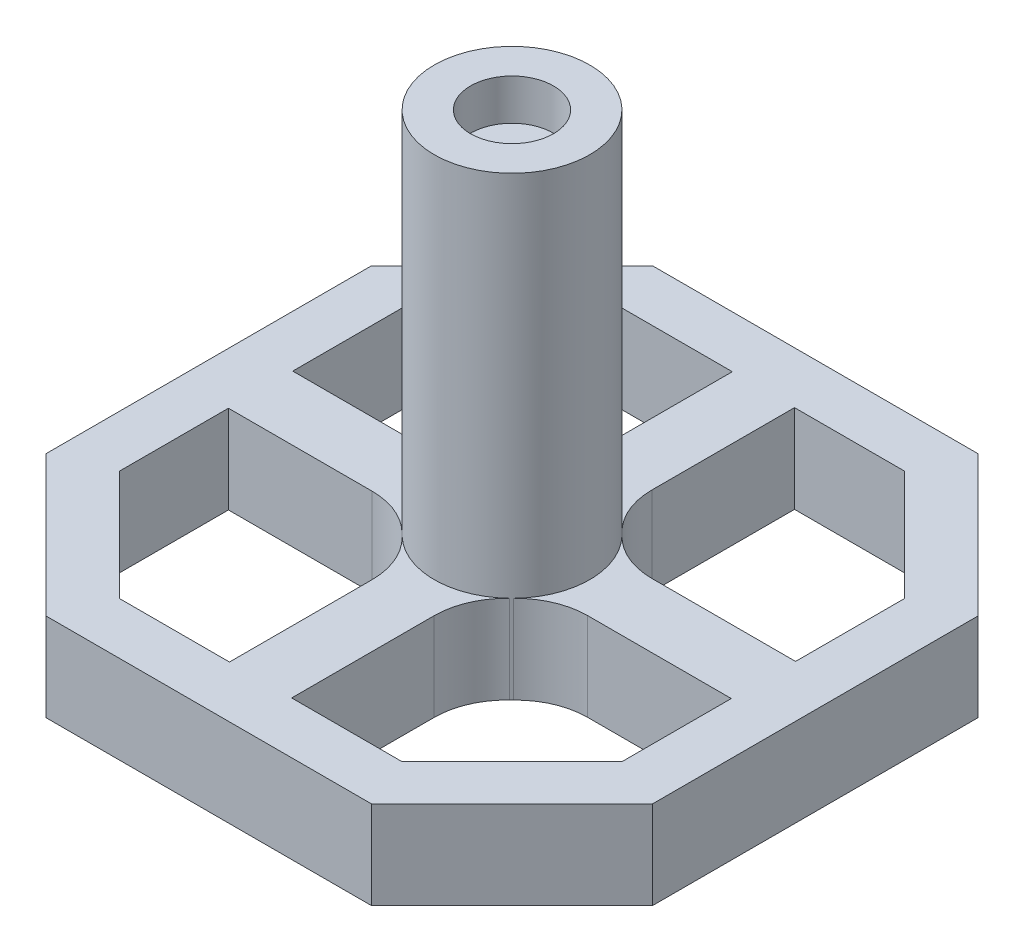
ISO-10303-21;
HEADER;
FILE_DESCRIPTION(('STEP AP214'),'2;1');
FILE_NAME('part.step','',(''),(''),'','','');
FILE_SCHEMA(('AUTOMOTIVE_DESIGN { 1 0 10303 214 1 1 1 1 }'));
ENDSEC;
DATA;
#1=APPLICATION_CONTEXT('core data for automotive mechanical design processes');
#2=APPLICATION_PROTOCOL_DEFINITION('international standard','automotive_design',2000,#1);
#3=PRODUCT_CONTEXT('',#1,'mechanical');
#4=PRODUCT('Part','Part','',(#3));
#5=PRODUCT_RELATED_PRODUCT_CATEGORY('part','',(#4));
#6=PRODUCT_DEFINITION_FORMATION('','',#4);
#7=PRODUCT_DEFINITION_CONTEXT('part definition',#1,'design');
#8=PRODUCT_DEFINITION('design','',#6,#7);
#9=PRODUCT_DEFINITION_SHAPE('','',#8);
#10=(LENGTH_UNIT() NAMED_UNIT(*) SI_UNIT(.MILLI.,.METRE.));
#11=(NAMED_UNIT(*) PLANE_ANGLE_UNIT() SI_UNIT($,.RADIAN.));
#12=(NAMED_UNIT(*) SI_UNIT($,.STERADIAN.) SOLID_ANGLE_UNIT());
#13=UNCERTAINTY_MEASURE_WITH_UNIT(LENGTH_MEASURE(1.E-05),#10,'distance_accuracy_value','');
#14=(GEOMETRIC_REPRESENTATION_CONTEXT(3) GLOBAL_UNCERTAINTY_ASSIGNED_CONTEXT((#13)) GLOBAL_UNIT_ASSIGNED_CONTEXT((#10,
#11,#12)) REPRESENTATION_CONTEXT('',''));
#15=CARTESIAN_POINT('',(0.,0.,0.));
#16=DIRECTION('',(0.,0.,1.));
#17=DIRECTION('',(1.,0.,0.));
#18=AXIS2_PLACEMENT_3D('',#15,#16,#17);
#19=CARTESIAN_POINT('',(0.,22.352,0.));
#20=DIRECTION('',(0.,-1.,0.));
#21=DIRECTION('',(0.,0.,-1.));
#22=AXIS2_PLACEMENT_3D('',#19,#20,#21);
#23=CYLINDRICAL_SURFACE('',#22,3.81);
#24=CARTESIAN_POINT('',(0.,0.,0.));
#25=DIRECTION('',(0.,1.,0.));
#26=DIRECTION('',(0.,0.,1.));
#27=AXIS2_PLACEMENT_3D('',#24,#25,#26);
#28=CIRCLE('',#27,3.81);
#29=CARTESIAN_POINT('',(2.7337000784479,0.,-2.65386206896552));
#30=VERTEX_POINT('',#29);
#31=CARTESIAN_POINT('',(2.62758620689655,0.,-2.75896551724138));
#32=VERTEX_POINT('',#31);
#33=EDGE_CURVE('E585',#30,#32,#28,.T.);
#34=ORIENTED_EDGE('',*,*,#33,.T.);
#35=DIRECTION('',(0.,-1.,0.));
#36=VECTOR('',#35,1.);
#37=CARTESIAN_POINT('',(2.62758620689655,22.352,-2.75896551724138));
#38=LINE('',#37,#36);
#39=CARTESIAN_POINT('',(2.62758620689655,4.318,-2.75896551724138));
#40=VERTEX_POINT('',#39);
#41=EDGE_CURVE('E617',#32,#40,#38,.F.);
#42=ORIENTED_EDGE('',*,*,#41,.T.);
#43=CARTESIAN_POINT('',(0.,4.318,0.));
#44=DIRECTION('',(0.,-1.,0.));
#45=DIRECTION('',(0.,0.,-1.));
#46=AXIS2_PLACEMENT_3D('',#43,#44,#45);
#47=CIRCLE('',#46,3.81);
#48=CARTESIAN_POINT('',(-2.62758620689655,4.318,-2.75896551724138));
#49=VERTEX_POINT('',#48);
#50=EDGE_CURVE('E369',#49,#40,#47,.T.);
#51=ORIENTED_EDGE('',*,*,#50,.F.);
#52=DIRECTION('',(0.,-1.,0.));
#53=VECTOR('',#52,1.);
#54=CARTESIAN_POINT('',(-2.62758620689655,22.352,-2.75896551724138));
#55=LINE('',#54,#53);
#56=CARTESIAN_POINT('',(-2.62758620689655,0.,-2.75896551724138));
#57=VERTEX_POINT('',#56);
#58=EDGE_CURVE('E609',#49,#57,#55,.T.);
#59=ORIENTED_EDGE('',*,*,#58,.T.);
#60=CARTESIAN_POINT('',(-2.7337000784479,0.,-2.65386206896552));
#61=VERTEX_POINT('',#60);
#62=EDGE_CURVE('E846',#57,#61,#28,.T.);
#63=ORIENTED_EDGE('',*,*,#62,.T.);
#64=DIRECTION('',(0.,-1.,0.));
#65=VECTOR('',#64,1.);
#66=CARTESIAN_POINT('',(-2.7337000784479,22.352,-2.65386206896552));
#67=LINE('',#66,#65);
#68=CARTESIAN_POINT('',(-2.7337000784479,4.318,-2.65386206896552));
#69=VERTEX_POINT('',#68);
#70=EDGE_CURVE('E605',#61,#69,#67,.F.);
#71=ORIENTED_EDGE('',*,*,#70,.T.);
#72=CARTESIAN_POINT('',(-2.7337000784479,4.318,2.65386206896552));
#73=VERTEX_POINT('',#72);
#74=EDGE_CURVE('E864',#73,#69,#47,.T.);
#75=ORIENTED_EDGE('',*,*,#74,.F.);
#76=DIRECTION('',(0.,-1.,0.));
#77=VECTOR('',#76,1.);
#78=CARTESIAN_POINT('',(-2.7337000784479,22.352,2.65386206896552));
#79=LINE('',#78,#77);
#80=CARTESIAN_POINT('',(-2.7337000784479,0.,2.65386206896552));
#81=VERTEX_POINT('',#80);
#82=EDGE_CURVE('E601',#73,#81,#79,.T.);
#83=ORIENTED_EDGE('',*,*,#82,.T.);
#84=CARTESIAN_POINT('',(-2.62758620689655,0.,2.75896551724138));
#85=VERTEX_POINT('',#84);
#86=EDGE_CURVE('E500',#81,#85,#28,.T.);
#87=ORIENTED_EDGE('',*,*,#86,.T.);
#88=DIRECTION('',(0.,-1.,0.));
#89=VECTOR('',#88,1.);
#90=CARTESIAN_POINT('',(-2.62758620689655,22.352,2.75896551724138));
#91=LINE('',#90,#89);
#92=CARTESIAN_POINT('',(-2.62758620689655,4.318,2.75896551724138));
#93=VERTEX_POINT('',#92);
#94=EDGE_CURVE('E597',#85,#93,#91,.F.);
#95=ORIENTED_EDGE('',*,*,#94,.T.);
#96=CARTESIAN_POINT('',(2.62758620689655,4.318,2.75896551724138));
#97=VERTEX_POINT('',#96);
#98=EDGE_CURVE('E309',#97,#93,#47,.T.);
#99=ORIENTED_EDGE('',*,*,#98,.F.);
#100=DIRECTION('',(0.,-1.,0.));
#101=VECTOR('',#100,1.);
#102=CARTESIAN_POINT('',(2.62758620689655,22.352,2.75896551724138));
#103=LINE('',#102,#101);
#104=CARTESIAN_POINT('',(2.62758620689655,0.,2.75896551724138));
#105=VERTEX_POINT('',#104);
#106=EDGE_CURVE('E593',#97,#105,#103,.T.);
#107=ORIENTED_EDGE('',*,*,#106,.T.);
#108=CARTESIAN_POINT('',(2.7337000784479,0.,2.65386206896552));
#109=VERTEX_POINT('',#108);
#110=EDGE_CURVE('E581',#105,#109,#28,.T.);
#111=ORIENTED_EDGE('',*,*,#110,.T.);
#112=DIRECTION('',(0.,-1.,0.));
#113=VECTOR('',#112,1.);
#114=CARTESIAN_POINT('',(2.7337000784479,22.352,2.65386206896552));
#115=LINE('',#114,#113);
#116=CARTESIAN_POINT('',(2.7337000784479,4.318,2.65386206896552));
#117=VERTEX_POINT('',#116);
#118=EDGE_CURVE('E589',#109,#117,#115,.F.);
#119=ORIENTED_EDGE('',*,*,#118,.T.);
#120=CARTESIAN_POINT('',(2.7337000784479,4.318,-2.65386206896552));
#121=VERTEX_POINT('',#120);
#122=EDGE_CURVE('E364',#121,#117,#47,.T.);
#123=ORIENTED_EDGE('',*,*,#122,.F.);
#124=DIRECTION('',(0.,-1.,0.));
#125=VECTOR('',#124,1.);
#126=CARTESIAN_POINT('',(2.7337000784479,22.352,-2.65386206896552));
#127=LINE('',#126,#125);
#128=EDGE_CURVE('E613',#121,#30,#127,.T.);
#129=ORIENTED_EDGE('',*,*,#128,.T.);
#130=EDGE_LOOP('',(#34,#42,#51,#59,#63,#71,#75,#83,#87,#95,#99,#107,#111,#119,#123,#129));
#131=FACE_BOUND('',#130,.T.);
#132=CARTESIAN_POINT('',(0.,22.352,0.));
#133=DIRECTION('',(0.,1.,0.));
#134=DIRECTION('',(0.,0.,1.));
#135=AXIS2_PLACEMENT_3D('',#132,#133,#134);
#136=CIRCLE('',#135,3.81);
#137=CARTESIAN_POINT('',(0.,22.352,3.81));
#138=VERTEX_POINT('',#137);
#139=EDGE_CURVE('E576',#138,#138,#136,.T.);
#140=ORIENTED_EDGE('',*,*,#139,.F.);
#141=EDGE_LOOP('',(#140));
#142=FACE_BOUND('',#141,.T.);
#143=ADVANCED_FACE('F41',(#131,#142),#23,.T.);
#144=CARTESIAN_POINT('',(0.,22.352,0.));
#145=DIRECTION('',(0.,1.,0.));
#146=DIRECTION('',(0.,0.,1.));
#147=AXIS2_PLACEMENT_3D('',#144,#145,#146);
#148=PLANE('',#147);
#149=CARTESIAN_POINT('',(0.,22.352,0.));
#150=DIRECTION('',(0.,1.,0.));
#151=DIRECTION('',(0.,0.,1.));
#152=AXIS2_PLACEMENT_3D('',#149,#150,#151);
#153=CIRCLE('',#152,2.032);
#154=CARTESIAN_POINT('',(0.,22.352,2.032));
#155=VERTEX_POINT('',#154);
#156=EDGE_CURVE('E902',#155,#155,#153,.T.);
#157=ORIENTED_EDGE('',*,*,#156,.F.);
#158=EDGE_LOOP('',(#157));
#159=FACE_BOUND('',#158,.T.);
#160=ORIENTED_EDGE('',*,*,#139,.T.);
#161=EDGE_LOOP('',(#160));
#162=FACE_BOUND('',#161,.T.);
#163=ADVANCED_FACE('F736',(#159,#162),#148,.T.);
#164=CARTESIAN_POINT('',(0.,0.,0.));
#165=DIRECTION('',(0.,1.,0.));
#166=DIRECTION('',(0.,0.,1.));
#167=AXIS2_PLACEMENT_3D('',#164,#165,#166);
#168=PLANE('',#167);
#169=DIRECTION('',(0.,0.,-1.));
#170=VECTOR('',#169,1.);
#171=CARTESIAN_POINT('',(-1.524,0.,0.));
#172=LINE('',#171,#170);
#173=CARTESIAN_POINT('',(-1.524,0.,12.319));
#174=VERTEX_POINT('',#173);
#175=CARTESIAN_POINT('',(-1.524,0.,5.334));
#176=VERTEX_POINT('',#175);
#177=EDGE_CURVE('E319',#174,#176,#172,.T.);
#178=ORIENTED_EDGE('',*,*,#177,.T.);
#179=CARTESIAN_POINT('',(-5.08,0.,5.334));
#180=DIRECTION('',(0.,1.,0.));
#181=DIRECTION('',(0.,0.,1.));
#182=AXIS2_PLACEMENT_3D('',#179,#180,#181);
#183=CIRCLE('',#182,3.556);
#184=EDGE_CURVE('E677',#176,#85,#183,.T.);
#185=ORIENTED_EDGE('',*,*,#184,.T.);
#186=ORIENTED_EDGE('',*,*,#86,.F.);
#187=CARTESIAN_POINT('',(-5.28515348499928,0.,5.1308));
#188=DIRECTION('',(0.,1.,0.));
#189=DIRECTION('',(0.,0.,1.));
#190=AXIS2_PLACEMENT_3D('',#187,#188,#189);
#191=CIRCLE('',#190,3.556);
#192=CARTESIAN_POINT('',(-5.28515348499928,0.,1.5748));
#193=VERTEX_POINT('',#192);
#194=EDGE_CURVE('E670',#81,#193,#191,.T.);
#195=ORIENTED_EDGE('',*,*,#194,.T.);
#196=DIRECTION('',(1.,0.,0.));
#197=VECTOR('',#196,1.);
#198=CARTESIAN_POINT('',(0.,0.,1.5748));
#199=LINE('',#198,#197);
#200=CARTESIAN_POINT('',(-12.319,0.,1.5748));
#201=VERTEX_POINT('',#200);
#202=EDGE_CURVE('E455',#201,#193,#199,.T.);
#203=ORIENTED_EDGE('',*,*,#202,.F.);
#204=DIRECTION('',(0.,0.,1.));
#205=VECTOR('',#204,1.);
#206=CARTESIAN_POINT('',(-12.319,0.,0.));
#207=LINE('',#206,#205);
#208=CARTESIAN_POINT('',(-12.319,0.,6.92149999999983));
#209=VERTEX_POINT('',#208);
#210=EDGE_CURVE('E485',#201,#209,#207,.T.);
#211=ORIENTED_EDGE('',*,*,#210,.T.);
#212=DIRECTION('',(-0.707106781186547,0.,-0.707106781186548));
#213=VECTOR('',#212,1.);
#214=CARTESIAN_POINT('',(-9.62024999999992,0.,9.62024999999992));
#215=LINE('',#214,#213);
#216=CARTESIAN_POINT('',(-6.92149999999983,0.,12.319));
#217=VERTEX_POINT('',#216);
#218=EDGE_CURVE('E489',#217,#209,#215,.T.);
#219=ORIENTED_EDGE('',*,*,#218,.F.);
#220=DIRECTION('',(1.,0.,0.));
#221=VECTOR('',#220,1.);
#222=CARTESIAN_POINT('',(0.,0.,12.319));
#223=LINE('',#222,#221);
#224=EDGE_CURVE('E493',#217,#174,#223,.T.);
#225=ORIENTED_EDGE('',*,*,#224,.T.);
#226=EDGE_LOOP('',(#178,#185,#186,#195,#203,#211,#219,#225));
#227=FACE_BOUND('',#226,.T.);
#228=DIRECTION('',(1.,0.,0.));
#229=VECTOR('',#228,1.);
#230=CARTESIAN_POINT('',(0.,0.,-1.5748));
#231=LINE('',#230,#229);
#232=CARTESIAN_POINT('',(-12.319,0.,-1.5748));
#233=VERTEX_POINT('',#232);
#234=CARTESIAN_POINT('',(-5.28515348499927,0.,-1.5748));
#235=VERTEX_POINT('',#234);
#236=EDGE_CURVE('E459',#233,#235,#231,.T.);
#237=ORIENTED_EDGE('',*,*,#236,.T.);
#238=CARTESIAN_POINT('',(-5.28515348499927,0.,-5.1308));
#239=DIRECTION('',(0.,1.,0.));
#240=DIRECTION('',(0.,0.,1.));
#241=AXIS2_PLACEMENT_3D('',#238,#239,#240);
#242=CIRCLE('',#241,3.556);
#243=EDGE_CURVE('E664',#235,#61,#242,.T.);
#244=ORIENTED_EDGE('',*,*,#243,.T.);
#245=ORIENTED_EDGE('',*,*,#62,.F.);
#246=CARTESIAN_POINT('',(-5.08,0.,-5.334));
#247=DIRECTION('',(0.,1.,0.));
#248=DIRECTION('',(0.,0.,1.));
#249=AXIS2_PLACEMENT_3D('',#246,#247,#248);
#250=CIRCLE('',#249,3.556);
#251=CARTESIAN_POINT('',(-1.524,0.,-5.334));
#252=VERTEX_POINT('',#251);
#253=EDGE_CURVE('E657',#57,#252,#250,.T.);
#254=ORIENTED_EDGE('',*,*,#253,.T.);
#255=CARTESIAN_POINT('',(-1.524,0.,-12.319));
#256=VERTEX_POINT('',#255);
#257=EDGE_CURVE('E470',#252,#256,#172,.T.);
#258=ORIENTED_EDGE('',*,*,#257,.T.);
#259=DIRECTION('',(-1.,0.,0.));
#260=VECTOR('',#259,1.);
#261=CARTESIAN_POINT('',(0.,0.,-12.319));
#262=LINE('',#261,#260);
#263=CARTESIAN_POINT('',(-6.92149999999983,0.,-12.319));
#264=VERTEX_POINT('',#263);
#265=EDGE_CURVE('E473',#256,#264,#262,.T.);
#266=ORIENTED_EDGE('',*,*,#265,.T.);
#267=DIRECTION('',(0.707106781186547,0.,-0.707106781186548));
#268=VECTOR('',#267,1.);
#269=CARTESIAN_POINT('',(-9.62024999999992,0.,-9.62024999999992));
#270=LINE('',#269,#268);
#271=CARTESIAN_POINT('',(-12.319,0.,-6.92149999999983));
#272=VERTEX_POINT('',#271);
#273=EDGE_CURVE('E477',#272,#264,#270,.T.);
#274=ORIENTED_EDGE('',*,*,#273,.F.);
#275=DIRECTION('',(0.,0.,1.));
#276=VECTOR('',#275,1.);
#277=CARTESIAN_POINT('',(-12.319,0.,0.));
#278=LINE('',#277,#276);
#279=EDGE_CURVE('E481',#272,#233,#278,.T.);
#280=ORIENTED_EDGE('',*,*,#279,.T.);
#281=EDGE_LOOP('',(#237,#244,#245,#254,#258,#266,#274,#280));
#282=FACE_BOUND('',#281,.T.);
#283=DIRECTION('',(0.,0.,-1.));
#284=VECTOR('',#283,1.);
#285=CARTESIAN_POINT('',(1.524,0.,0.));
#286=LINE('',#285,#284);
#287=CARTESIAN_POINT('',(1.524,0.,-5.334));
#288=VERTEX_POINT('',#287);
#289=CARTESIAN_POINT('',(1.524,0.,-12.319));
#290=VERTEX_POINT('',#289);
#291=EDGE_CURVE('E440',#288,#290,#286,.T.);
#292=ORIENTED_EDGE('',*,*,#291,.F.);
#293=CARTESIAN_POINT('',(5.08,0.,-5.334));
#294=DIRECTION('',(0.,1.,0.));
#295=DIRECTION('',(0.,0.,1.));
#296=AXIS2_PLACEMENT_3D('',#293,#294,#295);
#297=CIRCLE('',#296,3.556);
#298=EDGE_CURVE('E644',#288,#32,#297,.T.);
#299=ORIENTED_EDGE('',*,*,#298,.T.);
#300=ORIENTED_EDGE('',*,*,#33,.F.);
#301=CARTESIAN_POINT('',(5.28515348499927,0.,-5.1308));
#302=DIRECTION('',(0.,1.,0.));
#303=DIRECTION('',(0.,0.,1.));
#304=AXIS2_PLACEMENT_3D('',#301,#302,#303);
#305=CIRCLE('',#304,3.556);
#306=CARTESIAN_POINT('',(5.28515348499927,0.,-1.5748));
#307=VERTEX_POINT('',#306);
#308=EDGE_CURVE('E650',#30,#307,#305,.T.);
#309=ORIENTED_EDGE('',*,*,#308,.T.);
#310=CARTESIAN_POINT('',(12.319,0.,-1.5748));
#311=VERTEX_POINT('',#310);
#312=EDGE_CURVE('E454',#307,#311,#231,.T.);
#313=ORIENTED_EDGE('',*,*,#312,.T.);
#314=DIRECTION('',(0.,0.,1.));
#315=VECTOR('',#314,1.);
#316=CARTESIAN_POINT('',(12.319,0.,0.));
#317=LINE('',#316,#315);
#318=CARTESIAN_POINT('',(12.319,0.,-6.92149999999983));
#319=VERTEX_POINT('',#318);
#320=EDGE_CURVE('E458',#319,#311,#317,.T.);
#321=ORIENTED_EDGE('',*,*,#320,.F.);
#322=DIRECTION('',(0.707106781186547,0.,0.707106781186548));
#323=VECTOR('',#322,1.);
#324=CARTESIAN_POINT('',(9.62024999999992,0.,-9.62024999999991));
#325=LINE('',#324,#323);
#326=CARTESIAN_POINT('',(6.92149999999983,0.,-12.319));
#327=VERTEX_POINT('',#326);
#328=EDGE_CURVE('E463',#327,#319,#325,.T.);
#329=ORIENTED_EDGE('',*,*,#328,.F.);
#330=DIRECTION('',(-1.,0.,0.));
#331=VECTOR('',#330,1.);
#332=CARTESIAN_POINT('',(0.,0.,-12.319));
#333=LINE('',#332,#331);
#334=EDGE_CURVE('E466',#327,#290,#333,.T.);
#335=ORIENTED_EDGE('',*,*,#334,.T.);
#336=EDGE_LOOP('',(#292,#299,#300,#309,#313,#321,#329,#335));
#337=FACE_BOUND('',#336,.T.);
#338=ORIENTED_EDGE('',*,*,#110,.F.);
#339=CARTESIAN_POINT('',(5.08,0.,5.334));
#340=DIRECTION('',(0.,1.,0.));
#341=DIRECTION('',(0.,0.,1.));
#342=AXIS2_PLACEMENT_3D('',#339,#340,#341);
#343=CIRCLE('',#342,3.556);
#344=CARTESIAN_POINT('',(1.524,0.,5.334));
#345=VERTEX_POINT('',#344);
#346=EDGE_CURVE('E683',#105,#345,#343,.T.);
#347=ORIENTED_EDGE('',*,*,#346,.T.);
#348=CARTESIAN_POINT('',(1.524,0.,12.319));
#349=VERTEX_POINT('',#348);
#350=EDGE_CURVE('E435',#349,#345,#286,.T.);
#351=ORIENTED_EDGE('',*,*,#350,.F.);
#352=DIRECTION('',(1.,0.,0.));
#353=VECTOR('',#352,1.);
#354=CARTESIAN_POINT('',(0.,0.,12.319));
#355=LINE('',#354,#353);
#356=CARTESIAN_POINT('',(6.92149999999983,0.,12.319));
#357=VERTEX_POINT('',#356);
#358=EDGE_CURVE('E439',#349,#357,#355,.T.);
#359=ORIENTED_EDGE('',*,*,#358,.T.);
#360=DIRECTION('',(-0.707106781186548,0.,0.707106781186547));
#361=VECTOR('',#360,1.);
#362=CARTESIAN_POINT('',(9.62024999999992,0.,9.62024999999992));
#363=LINE('',#362,#361);
#364=CARTESIAN_POINT('',(12.319,0.,6.92149999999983));
#365=VERTEX_POINT('',#364);
#366=EDGE_CURVE('E444',#365,#357,#363,.T.);
#367=ORIENTED_EDGE('',*,*,#366,.F.);
#368=DIRECTION('',(0.,0.,1.));
#369=VECTOR('',#368,1.);
#370=CARTESIAN_POINT('',(12.319,0.,0.));
#371=LINE('',#370,#369);
#372=CARTESIAN_POINT('',(12.319,0.,1.5748));
#373=VERTEX_POINT('',#372);
#374=EDGE_CURVE('E448',#373,#365,#371,.T.);
#375=ORIENTED_EDGE('',*,*,#374,.F.);
#376=CARTESIAN_POINT('',(5.28515348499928,0.,1.5748));
#377=VERTEX_POINT('',#376);
#378=EDGE_CURVE('E451',#377,#373,#199,.T.);
#379=ORIENTED_EDGE('',*,*,#378,.F.);
#380=CARTESIAN_POINT('',(5.28515348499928,0.,5.1308));
#381=DIRECTION('',(0.,1.,0.));
#382=DIRECTION('',(0.,0.,1.));
#383=AXIS2_PLACEMENT_3D('',#380,#381,#382);
#384=CIRCLE('',#383,3.556);
#385=EDGE_CURVE('E50',#377,#109,#384,.T.);
#386=ORIENTED_EDGE('',*,*,#385,.T.);
#387=EDGE_LOOP('',(#338,#347,#351,#359,#367,#375,#379,#386));
#388=FACE_BOUND('',#387,.T.);
#389=DIRECTION('',(-0.707106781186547,0.,-0.707106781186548));
#390=VECTOR('',#389,1.);
#391=CARTESIAN_POINT('',(11.4163012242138,0.,-11.4163012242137));
#392=LINE('',#391,#390);
#393=CARTESIAN_POINT('',(14.859,0.,-7.97360244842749));
#394=VERTEX_POINT('',#393);
#395=CARTESIAN_POINT('',(7.97360244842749,0.,-14.859));
#396=VERTEX_POINT('',#395);
#397=EDGE_CURVE('E410',#394,#396,#392,.T.);
#398=ORIENTED_EDGE('',*,*,#397,.F.);
#399=DIRECTION('',(0.,0.,1.));
#400=VECTOR('',#399,1.);
#401=CARTESIAN_POINT('',(14.859,0.,0.));
#402=LINE('',#401,#400);
#403=CARTESIAN_POINT('',(14.859,0.,7.97360244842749));
#404=VERTEX_POINT('',#403);
#405=EDGE_CURVE('E303',#394,#404,#402,.T.);
#406=ORIENTED_EDGE('',*,*,#405,.T.);
#407=DIRECTION('',(0.707106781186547,0.,-0.707106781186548));
#408=VECTOR('',#407,1.);
#409=CARTESIAN_POINT('',(11.4163012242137,0.,11.4163012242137));
#410=LINE('',#409,#408);
#411=CARTESIAN_POINT('',(7.97360244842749,0.,14.859));
#412=VERTEX_POINT('',#411);
#413=EDGE_CURVE('E416',#412,#404,#410,.T.);
#414=ORIENTED_EDGE('',*,*,#413,.F.);
#415=DIRECTION('',(1.,0.,0.));
#416=VECTOR('',#415,1.);
#417=CARTESIAN_POINT('',(0.,0.,14.859));
#418=LINE('',#417,#416);
#419=CARTESIAN_POINT('',(-7.97360244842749,0.,14.859));
#420=VERTEX_POINT('',#419);
#421=EDGE_CURVE('E420',#420,#412,#418,.T.);
#422=ORIENTED_EDGE('',*,*,#421,.F.);
#423=DIRECTION('',(0.707106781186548,0.,0.707106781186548));
#424=VECTOR('',#423,1.);
#425=CARTESIAN_POINT('',(-11.4163012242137,0.,11.4163012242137));
#426=LINE('',#425,#424);
#427=CARTESIAN_POINT('',(-14.859,0.,7.97360244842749));
#428=VERTEX_POINT('',#427);
#429=EDGE_CURVE('E423',#428,#420,#426,.T.);
#430=ORIENTED_EDGE('',*,*,#429,.F.);
#431=DIRECTION('',(0.,0.,1.));
#432=VECTOR('',#431,1.);
#433=CARTESIAN_POINT('',(-14.859,0.,0.));
#434=LINE('',#433,#432);
#435=CARTESIAN_POINT('',(-14.859,0.,-7.9736024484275));
#436=VERTEX_POINT('',#435);
#437=EDGE_CURVE('E426',#436,#428,#434,.T.);
#438=ORIENTED_EDGE('',*,*,#437,.F.);
#439=DIRECTION('',(-0.707106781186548,0.,0.707106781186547));
#440=VECTOR('',#439,1.);
#441=CARTESIAN_POINT('',(-11.4163012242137,0.,-11.4163012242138));
#442=LINE('',#441,#440);
#443=CARTESIAN_POINT('',(-7.97360244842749,0.,-14.859));
#444=VERTEX_POINT('',#443);
#445=EDGE_CURVE('E429',#444,#436,#442,.T.);
#446=ORIENTED_EDGE('',*,*,#445,.F.);
#447=DIRECTION('',(-1.,0.,0.));
#448=VECTOR('',#447,1.);
#449=CARTESIAN_POINT('',(0.,0.,-14.859));
#450=LINE('',#449,#448);
#451=EDGE_CURVE('E432',#396,#444,#450,.T.);
#452=ORIENTED_EDGE('',*,*,#451,.F.);
#453=EDGE_LOOP('',(#398,#406,#414,#422,#430,#438,#446,#452));
#454=FACE_BOUND('',#453,.T.);
#455=ADVANCED_FACE('F693',(#227,#282,#337,#388,#454),#168,.F.);
#456=CARTESIAN_POINT('',(1.524,4.318,0.));
#457=DIRECTION('',(-1.,0.,0.));
#458=DIRECTION('',(0.,0.,1.));
#459=AXIS2_PLACEMENT_3D('',#456,#457,#458);
#460=PLANE('',#459);
#461=ORIENTED_EDGE('',*,*,#350,.T.);
#462=DIRECTION('',(0.,1.,0.));
#463=VECTOR('',#462,1.);
#464=CARTESIAN_POINT('',(1.524,4.318,5.334));
#465=LINE('',#464,#463);
#466=CARTESIAN_POINT('',(1.524,4.318,5.334));
#467=VERTEX_POINT('',#466);
#468=EDGE_CURVE('E638',#345,#467,#465,.T.);
#469=ORIENTED_EDGE('',*,*,#468,.T.);
#470=DIRECTION('',(0.,0.,-1.));
#471=VECTOR('',#470,1.);
#472=CARTESIAN_POINT('',(1.524,4.318,0.));
#473=LINE('',#472,#471);
#474=CARTESIAN_POINT('',(1.524,4.318,12.319));
#475=VERTEX_POINT('',#474);
#476=EDGE_CURVE('E346',#475,#467,#473,.T.);
#477=ORIENTED_EDGE('',*,*,#476,.F.);
#478=DIRECTION('',(0.,-1.,0.));
#479=VECTOR('',#478,1.);
#480=CARTESIAN_POINT('',(1.524,4.318,12.319));
#481=LINE('',#480,#479);
#482=EDGE_CURVE('E549',#475,#349,#481,.T.);
#483=ORIENTED_EDGE('',*,*,#482,.T.);
#484=EDGE_LOOP('',(#461,#469,#477,#483));
#485=FACE_BOUND('',#484,.T.);
#486=ADVANCED_FACE('F723',(#485),#460,.F.);
#487=CARTESIAN_POINT('',(-1.524,4.318,0.));
#488=DIRECTION('',(-1.,0.,0.));
#489=DIRECTION('',(0.,0.,1.));
#490=AXIS2_PLACEMENT_3D('',#487,#488,#489);
#491=PLANE('',#490);
#492=DIRECTION('',(0.,0.,-1.));
#493=VECTOR('',#492,1.);
#494=CARTESIAN_POINT('',(-1.524,4.318,0.));
#495=LINE('',#494,#493);
#496=CARTESIAN_POINT('',(-1.524,4.318,12.319));
#497=VERTEX_POINT('',#496);
#498=CARTESIAN_POINT('',(-1.524,4.318,5.334));
#499=VERTEX_POINT('',#498);
#500=EDGE_CURVE('E388',#497,#499,#495,.T.);
#501=ORIENTED_EDGE('',*,*,#500,.T.);
#502=DIRECTION('',(0.,-1.,0.));
#503=VECTOR('',#502,1.);
#504=CARTESIAN_POINT('',(-1.524,4.318,5.334));
#505=LINE('',#504,#503);
#506=EDGE_CURVE('E634',#499,#176,#505,.T.);
#507=ORIENTED_EDGE('',*,*,#506,.T.);
#508=ORIENTED_EDGE('',*,*,#177,.F.);
#509=DIRECTION('',(0.,-1.,0.));
#510=VECTOR('',#509,1.);
#511=CARTESIAN_POINT('',(-1.524,4.318,12.319));
#512=LINE('',#511,#510);
#513=EDGE_CURVE('E497',#497,#174,#512,.T.);
#514=ORIENTED_EDGE('',*,*,#513,.F.);
#515=EDGE_LOOP('',(#501,#507,#508,#514));
#516=FACE_BOUND('',#515,.T.);
#517=ADVANCED_FACE('F725',(#516),#491,.T.);
#518=CARTESIAN_POINT('',(0.,4.318,12.319));
#519=DIRECTION('',(0.,0.,-1.));
#520=DIRECTION('',(-1.,0.,0.));
#521=AXIS2_PLACEMENT_3D('',#518,#519,#520);
#522=PLANE('',#521);
#523=ORIENTED_EDGE('',*,*,#224,.F.);
#524=DIRECTION('',(0.,-1.,0.));
#525=VECTOR('',#524,1.);
#526=CARTESIAN_POINT('',(-6.92149999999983,4.318,12.319));
#527=LINE('',#526,#525);
#528=CARTESIAN_POINT('',(-6.92149999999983,4.318,12.319));
#529=VERTEX_POINT('',#528);
#530=EDGE_CURVE('E501',#529,#217,#527,.T.);
#531=ORIENTED_EDGE('',*,*,#530,.F.);
#532=DIRECTION('',(1.,0.,0.));
#533=VECTOR('',#532,1.);
#534=CARTESIAN_POINT('',(0.,4.318,12.319));
#535=LINE('',#534,#533);
#536=EDGE_CURVE('E406',#529,#497,#535,.T.);
#537=ORIENTED_EDGE('',*,*,#536,.T.);
#538=ORIENTED_EDGE('',*,*,#513,.T.);
#539=EDGE_LOOP('',(#523,#531,#537,#538));
#540=FACE_BOUND('',#539,.T.);
#541=ADVANCED_FACE('F732',(#540),#522,.T.);
#542=CARTESIAN_POINT('',(-9.62024999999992,4.318,9.62024999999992));
#543=DIRECTION('',(-0.707106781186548,0.,0.707106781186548));
#544=DIRECTION('',(0.707106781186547,0.,0.707106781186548));
#545=AXIS2_PLACEMENT_3D('',#542,#543,#544);
#546=PLANE('',#545);
#547=ORIENTED_EDGE('',*,*,#218,.T.);
#548=DIRECTION('',(0.,-1.,0.));
#549=VECTOR('',#548,1.);
#550=CARTESIAN_POINT('',(-12.319,4.318,6.92149999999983));
#551=LINE('',#550,#549);
#552=CARTESIAN_POINT('',(-12.319,4.318,6.92149999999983));
#553=VERTEX_POINT('',#552);
#554=EDGE_CURVE('E504',#553,#209,#551,.T.);
#555=ORIENTED_EDGE('',*,*,#554,.F.);
#556=DIRECTION('',(-0.707106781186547,0.,-0.707106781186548));
#557=VECTOR('',#556,1.);
#558=CARTESIAN_POINT('',(-9.62024999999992,4.318,9.62024999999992));
#559=LINE('',#558,#557);
#560=EDGE_CURVE('E403',#529,#553,#559,.T.);
#561=ORIENTED_EDGE('',*,*,#560,.F.);
#562=ORIENTED_EDGE('',*,*,#530,.T.);
#563=EDGE_LOOP('',(#547,#555,#561,#562));
#564=FACE_BOUND('',#563,.T.);
#565=ADVANCED_FACE('F798',(#564),#546,.F.);
#566=CARTESIAN_POINT('',(-12.319,4.318,0.));
#567=DIRECTION('',(1.,0.,0.));
#568=DIRECTION('',(0.,0.,-1.));
#569=AXIS2_PLACEMENT_3D('',#566,#567,#568);
#570=PLANE('',#569);
#571=ORIENTED_EDGE('',*,*,#210,.F.);
#572=DIRECTION('',(0.,-1.,0.));
#573=VECTOR('',#572,1.);
#574=CARTESIAN_POINT('',(-12.319,4.318,1.5748));
#575=LINE('',#574,#573);
#576=CARTESIAN_POINT('',(-12.319,4.318,1.5748));
#577=VERTEX_POINT('',#576);
#578=EDGE_CURVE('E507',#577,#201,#575,.T.);
#579=ORIENTED_EDGE('',*,*,#578,.F.);
#580=DIRECTION('',(0.,0.,1.));
#581=VECTOR('',#580,1.);
#582=CARTESIAN_POINT('',(-12.319,4.318,0.));
#583=LINE('',#582,#581);
#584=EDGE_CURVE('E399',#577,#553,#583,.T.);
#585=ORIENTED_EDGE('',*,*,#584,.T.);
#586=ORIENTED_EDGE('',*,*,#554,.T.);
#587=EDGE_LOOP('',(#571,#579,#585,#586));
#588=FACE_BOUND('',#587,.T.);
#589=ADVANCED_FACE('F802',(#588),#570,.T.);
#590=CARTESIAN_POINT('',(0.,4.318,1.5748));
#591=DIRECTION('',(0.,0.,-1.));
#592=DIRECTION('',(-1.,0.,0.));
#593=AXIS2_PLACEMENT_3D('',#590,#591,#592);
#594=PLANE('',#593);
#595=ORIENTED_EDGE('',*,*,#202,.T.);
#596=DIRECTION('',(0.,1.,0.));
#597=VECTOR('',#596,1.);
#598=CARTESIAN_POINT('',(-5.28515348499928,4.318,1.5748));
#599=LINE('',#598,#597);
#600=CARTESIAN_POINT('',(-5.28515348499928,4.318,1.5748));
#601=VERTEX_POINT('',#600);
#602=EDGE_CURVE('E631',#193,#601,#599,.T.);
#603=ORIENTED_EDGE('',*,*,#602,.T.);
#604=DIRECTION('',(1.,0.,0.));
#605=VECTOR('',#604,1.);
#606=CARTESIAN_POINT('',(0.,4.318,1.5748));
#607=LINE('',#606,#605);
#608=EDGE_CURVE('E365',#577,#601,#607,.T.);
#609=ORIENTED_EDGE('',*,*,#608,.F.);
#610=ORIENTED_EDGE('',*,*,#578,.T.);
#611=EDGE_LOOP('',(#595,#603,#609,#610));
#612=FACE_BOUND('',#611,.T.);
#613=ADVANCED_FACE('F806',(#612),#594,.F.);
#614=CARTESIAN_POINT('',(0.,4.318,-1.5748));
#615=DIRECTION('',(0.,0.,-1.));
#616=DIRECTION('',(-1.,0.,0.));
#617=AXIS2_PLACEMENT_3D('',#614,#615,#616);
#618=PLANE('',#617);
#619=DIRECTION('',(1.,0.,0.));
#620=VECTOR('',#619,1.);
#621=CARTESIAN_POINT('',(0.,4.318,-1.5748));
#622=LINE('',#621,#620);
#623=CARTESIAN_POINT('',(-12.319,4.318,-1.5748));
#624=VERTEX_POINT('',#623);
#625=CARTESIAN_POINT('',(-5.28515348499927,4.318,-1.5748));
#626=VERTEX_POINT('',#625);
#627=EDGE_CURVE('E373',#624,#626,#622,.T.);
#628=ORIENTED_EDGE('',*,*,#627,.T.);
#629=DIRECTION('',(0.,-1.,0.));
#630=VECTOR('',#629,1.);
#631=CARTESIAN_POINT('',(-5.28515348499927,4.318,-1.5748));
#632=LINE('',#631,#630);
#633=EDGE_CURVE('E627',#626,#235,#632,.T.);
#634=ORIENTED_EDGE('',*,*,#633,.T.);
#635=ORIENTED_EDGE('',*,*,#236,.F.);
#636=DIRECTION('',(0.,-1.,0.));
#637=VECTOR('',#636,1.);
#638=CARTESIAN_POINT('',(-12.319,4.318,-1.5748));
#639=LINE('',#638,#637);
#640=EDGE_CURVE('E510',#624,#233,#639,.T.);
#641=ORIENTED_EDGE('',*,*,#640,.F.);
#642=EDGE_LOOP('',(#628,#634,#635,#641));
#643=FACE_BOUND('',#642,.T.);
#644=ADVANCED_FACE('F810',(#643),#618,.T.);
#645=CARTESIAN_POINT('',(-12.319,4.318,0.));
#646=DIRECTION('',(1.,0.,0.));
#647=DIRECTION('',(0.,0.,-1.));
#648=AXIS2_PLACEMENT_3D('',#645,#646,#647);
#649=PLANE('',#648);
#650=ORIENTED_EDGE('',*,*,#279,.F.);
#651=DIRECTION('',(0.,-1.,0.));
#652=VECTOR('',#651,1.);
#653=CARTESIAN_POINT('',(-12.319,4.318,-6.92149999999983));
#654=LINE('',#653,#652);
#655=CARTESIAN_POINT('',(-12.319,4.318,-6.92149999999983));
#656=VERTEX_POINT('',#655);
#657=EDGE_CURVE('E513',#656,#272,#654,.T.);
#658=ORIENTED_EDGE('',*,*,#657,.F.);
#659=DIRECTION('',(0.,0.,1.));
#660=VECTOR('',#659,1.);
#661=CARTESIAN_POINT('',(-12.319,4.318,0.));
#662=LINE('',#661,#660);
#663=EDGE_CURVE('E395',#656,#624,#662,.T.);
#664=ORIENTED_EDGE('',*,*,#663,.T.);
#665=ORIENTED_EDGE('',*,*,#640,.T.);
#666=EDGE_LOOP('',(#650,#658,#664,#665));
#667=FACE_BOUND('',#666,.T.);
#668=ADVANCED_FACE('F814',(#667),#649,.T.);
#669=CARTESIAN_POINT('',(-9.62024999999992,4.318,-9.62024999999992));
#670=DIRECTION('',(-0.707106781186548,0.,-0.707106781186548));
#671=DIRECTION('',(-0.707106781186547,0.,0.707106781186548));
#672=AXIS2_PLACEMENT_3D('',#669,#670,#671);
#673=PLANE('',#672);
#674=ORIENTED_EDGE('',*,*,#273,.T.);
#675=DIRECTION('',(0.,-1.,0.));
#676=VECTOR('',#675,1.);
#677=CARTESIAN_POINT('',(-6.92149999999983,4.318,-12.319));
#678=LINE('',#677,#676);
#679=CARTESIAN_POINT('',(-6.92149999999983,4.318,-12.319));
#680=VERTEX_POINT('',#679);
#681=EDGE_CURVE('E516',#680,#264,#678,.T.);
#682=ORIENTED_EDGE('',*,*,#681,.F.);
#683=DIRECTION('',(0.707106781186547,0.,-0.707106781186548));
#684=VECTOR('',#683,1.);
#685=CARTESIAN_POINT('',(-9.62024999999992,4.318,-9.62024999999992));
#686=LINE('',#685,#684);
#687=EDGE_CURVE('E392',#656,#680,#686,.T.);
#688=ORIENTED_EDGE('',*,*,#687,.F.);
#689=ORIENTED_EDGE('',*,*,#657,.T.);
#690=EDGE_LOOP('',(#674,#682,#688,#689));
#691=FACE_BOUND('',#690,.T.);
#692=ADVANCED_FACE('F819',(#691),#673,.F.);
#693=CARTESIAN_POINT('',(0.,4.318,-12.319));
#694=DIRECTION('',(0.,0.,1.));
#695=DIRECTION('',(1.,0.,0.));
#696=AXIS2_PLACEMENT_3D('',#693,#694,#695);
#697=PLANE('',#696);
#698=ORIENTED_EDGE('',*,*,#265,.F.);
#699=DIRECTION('',(0.,-1.,0.));
#700=VECTOR('',#699,1.);
#701=CARTESIAN_POINT('',(-1.524,4.318,-12.319));
#702=LINE('',#701,#700);
#703=CARTESIAN_POINT('',(-1.524,4.318,-12.319));
#704=VERTEX_POINT('',#703);
#705=EDGE_CURVE('E519',#704,#256,#702,.T.);
#706=ORIENTED_EDGE('',*,*,#705,.F.);
#707=DIRECTION('',(-1.,0.,0.));
#708=VECTOR('',#707,1.);
#709=CARTESIAN_POINT('',(0.,4.318,-12.319));
#710=LINE('',#709,#708);
#711=EDGE_CURVE('E387',#704,#680,#710,.T.);
#712=ORIENTED_EDGE('',*,*,#711,.T.);
#713=ORIENTED_EDGE('',*,*,#681,.T.);
#714=EDGE_LOOP('',(#698,#706,#712,#713));
#715=FACE_BOUND('',#714,.T.);
#716=ADVANCED_FACE('F822',(#715),#697,.T.);
#717=ORIENTED_EDGE('',*,*,#257,.F.);
#718=DIRECTION('',(0.,-1.,0.));
#719=VECTOR('',#718,1.);
#720=CARTESIAN_POINT('',(-1.524,4.318,-5.334));
#721=LINE('',#720,#719);
#722=CARTESIAN_POINT('',(-1.524,4.318,-5.334));
#723=VERTEX_POINT('',#722);
#724=EDGE_CURVE('E624',#252,#723,#721,.F.);
#725=ORIENTED_EDGE('',*,*,#724,.T.);
#726=EDGE_CURVE('E384',#723,#704,#495,.T.);
#727=ORIENTED_EDGE('',*,*,#726,.T.);
#728=ORIENTED_EDGE('',*,*,#705,.T.);
#729=EDGE_LOOP('',(#717,#725,#727,#728));
#730=FACE_BOUND('',#729,.T.);
#731=ADVANCED_FACE('F735',(#730),#491,.T.);
#732=CARTESIAN_POINT('',(1.524,4.318,-5.334));
#733=VERTEX_POINT('',#732);
#734=CARTESIAN_POINT('',(1.524,4.318,-12.319));
#735=VERTEX_POINT('',#734);
#736=EDGE_CURVE('E351',#733,#735,#473,.T.);
#737=ORIENTED_EDGE('',*,*,#736,.F.);
#738=DIRECTION('',(0.,1.,0.));
#739=VECTOR('',#738,1.);
#740=CARTESIAN_POINT('',(1.524,0.,-5.334));
#741=LINE('',#740,#739);
#742=EDGE_CURVE('E580',#733,#288,#741,.F.);
#743=ORIENTED_EDGE('',*,*,#742,.T.);
#744=ORIENTED_EDGE('',*,*,#291,.T.);
#745=DIRECTION('',(0.,-1.,0.));
#746=VECTOR('',#745,1.);
#747=CARTESIAN_POINT('',(1.524,4.318,-12.319));
#748=LINE('',#747,#746);
#749=EDGE_CURVE('E523',#735,#290,#748,.T.);
#750=ORIENTED_EDGE('',*,*,#749,.F.);
#751=EDGE_LOOP('',(#737,#743,#744,#750));
#752=FACE_BOUND('',#751,.T.);
#753=ADVANCED_FACE('F727',(#752),#460,.F.);
#754=CARTESIAN_POINT('',(0.,4.318,-12.319));
#755=DIRECTION('',(0.,0.,1.));
#756=DIRECTION('',(1.,0.,0.));
#757=AXIS2_PLACEMENT_3D('',#754,#755,#756);
#758=PLANE('',#757);
#759=ORIENTED_EDGE('',*,*,#334,.F.);
#760=DIRECTION('',(0.,-1.,0.));
#761=VECTOR('',#760,1.);
#762=CARTESIAN_POINT('',(6.92149999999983,4.318,-12.319));
#763=LINE('',#762,#761);
#764=CARTESIAN_POINT('',(6.92149999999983,4.318,-12.319));
#765=VERTEX_POINT('',#764);
#766=EDGE_CURVE('E527',#765,#327,#763,.T.);
#767=ORIENTED_EDGE('',*,*,#766,.F.);
#768=DIRECTION('',(-1.,0.,0.));
#769=VECTOR('',#768,1.);
#770=CARTESIAN_POINT('',(0.,4.318,-12.319));
#771=LINE('',#770,#769);
#772=EDGE_CURVE('E380',#765,#735,#771,.T.);
#773=ORIENTED_EDGE('',*,*,#772,.T.);
#774=ORIENTED_EDGE('',*,*,#749,.T.);
#775=EDGE_LOOP('',(#759,#767,#773,#774));
#776=FACE_BOUND('',#775,.T.);
#777=ADVANCED_FACE('F742',(#776),#758,.T.);
#778=CARTESIAN_POINT('',(9.62024999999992,4.318,-9.62024999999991));
#779=DIRECTION('',(0.707106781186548,0.,-0.707106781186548));
#780=DIRECTION('',(-0.707106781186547,0.,-0.707106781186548));
#781=AXIS2_PLACEMENT_3D('',#778,#779,#780);
#782=PLANE('',#781);
#783=ORIENTED_EDGE('',*,*,#328,.T.);
#784=DIRECTION('',(0.,-1.,0.));
#785=VECTOR('',#784,1.);
#786=CARTESIAN_POINT('',(12.319,4.318,-6.92149999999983));
#787=LINE('',#786,#785);
#788=CARTESIAN_POINT('',(12.319,4.318,-6.92149999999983));
#789=VERTEX_POINT('',#788);
#790=EDGE_CURVE('E530',#789,#319,#787,.T.);
#791=ORIENTED_EDGE('',*,*,#790,.F.);
#792=DIRECTION('',(0.707106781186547,0.,0.707106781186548));
#793=VECTOR('',#792,1.);
#794=CARTESIAN_POINT('',(9.62024999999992,4.318,-9.62024999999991));
#795=LINE('',#794,#793);
#796=EDGE_CURVE('E377',#765,#789,#795,.T.);
#797=ORIENTED_EDGE('',*,*,#796,.F.);
#798=ORIENTED_EDGE('',*,*,#766,.T.);
#799=EDGE_LOOP('',(#783,#791,#797,#798));
#800=FACE_BOUND('',#799,.T.);
#801=ADVANCED_FACE('F884',(#800),#782,.F.);
#802=CARTESIAN_POINT('',(12.319,4.318,0.));
#803=DIRECTION('',(1.,0.,0.));
#804=DIRECTION('',(0.,0.,-1.));
#805=AXIS2_PLACEMENT_3D('',#802,#803,#804);
#806=PLANE('',#805);
#807=ORIENTED_EDGE('',*,*,#320,.T.);
#808=DIRECTION('',(0.,-1.,0.));
#809=VECTOR('',#808,1.);
#810=CARTESIAN_POINT('',(12.319,4.318,-1.5748));
#811=LINE('',#810,#809);
#812=CARTESIAN_POINT('',(12.319,4.318,-1.5748));
#813=VERTEX_POINT('',#812);
#814=EDGE_CURVE('E534',#813,#311,#811,.T.);
#815=ORIENTED_EDGE('',*,*,#814,.F.);
#816=DIRECTION('',(0.,0.,1.));
#817=VECTOR('',#816,1.);
#818=CARTESIAN_POINT('',(12.319,4.318,0.));
#819=LINE('',#818,#817);
#820=EDGE_CURVE('E372',#789,#813,#819,.T.);
#821=ORIENTED_EDGE('',*,*,#820,.F.);
#822=ORIENTED_EDGE('',*,*,#790,.T.);
#823=EDGE_LOOP('',(#807,#815,#821,#822));
#824=FACE_BOUND('',#823,.T.);
#825=ADVANCED_FACE('F890',(#824),#806,.F.);
#826=ORIENTED_EDGE('',*,*,#312,.F.);
#827=DIRECTION('',(0.,-1.,0.));
#828=VECTOR('',#827,1.);
#829=CARTESIAN_POINT('',(5.28515348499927,4.318,-1.5748));
#830=LINE('',#829,#828);
#831=CARTESIAN_POINT('',(5.28515348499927,4.318,-1.5748));
#832=VERTEX_POINT('',#831);
#833=EDGE_CURVE('E621',#307,#832,#830,.F.);
#834=ORIENTED_EDGE('',*,*,#833,.T.);
#835=EDGE_CURVE('E368',#832,#813,#622,.T.);
#836=ORIENTED_EDGE('',*,*,#835,.T.);
#837=ORIENTED_EDGE('',*,*,#814,.T.);
#838=EDGE_LOOP('',(#826,#834,#836,#837));
#839=FACE_BOUND('',#838,.T.);
#840=ADVANCED_FACE('F816',(#839),#618,.T.);
#841=CARTESIAN_POINT('',(5.28515348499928,4.318,1.5748));
#842=VERTEX_POINT('',#841);
#843=CARTESIAN_POINT('',(12.319,4.318,1.5748));
#844=VERTEX_POINT('',#843);
#845=EDGE_CURVE('E361',#842,#844,#607,.T.);
#846=ORIENTED_EDGE('',*,*,#845,.F.);
#847=DIRECTION('',(0.,1.,0.));
#848=VECTOR('',#847,1.);
#849=CARTESIAN_POINT('',(5.28515348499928,0.,1.5748));
#850=LINE('',#849,#848);
#851=EDGE_CURVE('E641',#842,#377,#850,.F.);
#852=ORIENTED_EDGE('',*,*,#851,.T.);
#853=ORIENTED_EDGE('',*,*,#378,.T.);
#854=DIRECTION('',(0.,-1.,0.));
#855=VECTOR('',#854,1.);
#856=CARTESIAN_POINT('',(12.319,4.318,1.5748));
#857=LINE('',#856,#855);
#858=EDGE_CURVE('E538',#844,#373,#857,.T.);
#859=ORIENTED_EDGE('',*,*,#858,.F.);
#860=EDGE_LOOP('',(#846,#852,#853,#859));
#861=FACE_BOUND('',#860,.T.);
#862=ADVANCED_FACE('F701',(#861),#594,.F.);
#863=CARTESIAN_POINT('',(12.319,4.318,0.));
#864=DIRECTION('',(1.,0.,0.));
#865=DIRECTION('',(0.,0.,-1.));
#866=AXIS2_PLACEMENT_3D('',#863,#864,#865);
#867=PLANE('',#866);
#868=ORIENTED_EDGE('',*,*,#374,.T.);
#869=DIRECTION('',(0.,-1.,0.));
#870=VECTOR('',#869,1.);
#871=CARTESIAN_POINT('',(12.319,4.318,6.92149999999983));
#872=LINE('',#871,#870);
#873=CARTESIAN_POINT('',(12.319,4.318,6.92149999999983));
#874=VERTEX_POINT('',#873);
#875=EDGE_CURVE('E542',#874,#365,#872,.T.);
#876=ORIENTED_EDGE('',*,*,#875,.F.);
#877=DIRECTION('',(0.,0.,1.));
#878=VECTOR('',#877,1.);
#879=CARTESIAN_POINT('',(12.319,4.318,0.));
#880=LINE('',#879,#878);
#881=EDGE_CURVE('E358',#844,#874,#880,.T.);
#882=ORIENTED_EDGE('',*,*,#881,.F.);
#883=ORIENTED_EDGE('',*,*,#858,.T.);
#884=EDGE_LOOP('',(#868,#876,#882,#883));
#885=FACE_BOUND('',#884,.T.);
#886=ADVANCED_FACE('F709',(#885),#867,.F.);
#887=CARTESIAN_POINT('',(9.62024999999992,4.318,9.62024999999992));
#888=DIRECTION('',(0.707106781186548,0.,0.707106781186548));
#889=DIRECTION('',(0.707106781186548,0.,-0.707106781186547));
#890=AXIS2_PLACEMENT_3D('',#887,#888,#889);
#891=PLANE('',#890);
#892=ORIENTED_EDGE('',*,*,#366,.T.);
#893=DIRECTION('',(0.,-1.,0.));
#894=VECTOR('',#893,1.);
#895=CARTESIAN_POINT('',(6.92149999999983,4.318,12.319));
#896=LINE('',#895,#894);
#897=CARTESIAN_POINT('',(6.92149999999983,4.318,12.319));
#898=VERTEX_POINT('',#897);
#899=EDGE_CURVE('E546',#898,#357,#896,.T.);
#900=ORIENTED_EDGE('',*,*,#899,.F.);
#901=DIRECTION('',(-0.707106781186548,0.,0.707106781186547));
#902=VECTOR('',#901,1.);
#903=CARTESIAN_POINT('',(9.62024999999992,4.318,9.62024999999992));
#904=LINE('',#903,#902);
#905=EDGE_CURVE('E355',#874,#898,#904,.T.);
#906=ORIENTED_EDGE('',*,*,#905,.F.);
#907=ORIENTED_EDGE('',*,*,#875,.T.);
#908=EDGE_LOOP('',(#892,#900,#906,#907));
#909=FACE_BOUND('',#908,.T.);
#910=ADVANCED_FACE('F712',(#909),#891,.F.);
#911=CARTESIAN_POINT('',(11.4163012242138,4.318,-11.4163012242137));
#912=DIRECTION('',(-0.707106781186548,0.,0.707106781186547));
#913=DIRECTION('',(0.707106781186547,0.,0.707106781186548));
#914=AXIS2_PLACEMENT_3D('',#911,#912,#913);
#915=PLANE('',#914);
#916=ORIENTED_EDGE('',*,*,#397,.T.);
#917=DIRECTION('',(0.,-1.,0.));
#918=VECTOR('',#917,1.);
#919=CARTESIAN_POINT('',(7.97360244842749,4.318,-14.859));
#920=LINE('',#919,#918);
#921=CARTESIAN_POINT('',(7.97360244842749,4.318,-14.859));
#922=VERTEX_POINT('',#921);
#923=EDGE_CURVE('E316',#922,#396,#920,.T.);
#924=ORIENTED_EDGE('',*,*,#923,.F.);
#925=DIRECTION('',(-0.707106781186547,0.,-0.707106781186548));
#926=VECTOR('',#925,1.);
#927=CARTESIAN_POINT('',(11.4163012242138,4.318,-11.4163012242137));
#928=LINE('',#927,#926);
#929=CARTESIAN_POINT('',(14.859,4.318,-7.97360244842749));
#930=VERTEX_POINT('',#929);
#931=EDGE_CURVE('E313',#930,#922,#928,.T.);
#932=ORIENTED_EDGE('',*,*,#931,.F.);
#933=DIRECTION('',(0.,-1.,0.));
#934=VECTOR('',#933,1.);
#935=CARTESIAN_POINT('',(14.859,4.318,-7.97360244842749));
#936=LINE('',#935,#934);
#937=EDGE_CURVE('E297',#930,#394,#936,.T.);
#938=ORIENTED_EDGE('',*,*,#937,.T.);
#939=EDGE_LOOP('',(#916,#924,#932,#938));
#940=FACE_BOUND('',#939,.T.);
#941=ADVANCED_FACE('F314',(#940),#915,.F.);
#942=CARTESIAN_POINT('',(0.,4.318,-14.859));
#943=DIRECTION('',(0.,0.,1.));
#944=DIRECTION('',(1.,0.,0.));
#945=AXIS2_PLACEMENT_3D('',#942,#943,#944);
#946=PLANE('',#945);
#947=ORIENTED_EDGE('',*,*,#451,.T.);
#948=DIRECTION('',(0.,-1.,0.));
#949=VECTOR('',#948,1.);
#950=CARTESIAN_POINT('',(-7.97360244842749,4.318,-14.859));
#951=LINE('',#950,#949);
#952=CARTESIAN_POINT('',(-7.97360244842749,4.318,-14.859));
#953=VERTEX_POINT('',#952);
#954=EDGE_CURVE('E554',#953,#444,#951,.T.);
#955=ORIENTED_EDGE('',*,*,#954,.F.);
#956=DIRECTION('',(-1.,0.,0.));
#957=VECTOR('',#956,1.);
#958=CARTESIAN_POINT('',(0.,4.318,-14.859));
#959=LINE('',#958,#957);
#960=EDGE_CURVE('E343',#922,#953,#959,.T.);
#961=ORIENTED_EDGE('',*,*,#960,.F.);
#962=ORIENTED_EDGE('',*,*,#923,.T.);
#963=EDGE_LOOP('',(#947,#955,#961,#962));
#964=FACE_BOUND('',#963,.T.);
#965=ADVANCED_FACE('F945',(#964),#946,.F.);
#966=CARTESIAN_POINT('',(-11.4163012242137,4.318,-11.4163012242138));
#967=DIRECTION('',(0.707106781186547,0.,0.707106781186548));
#968=DIRECTION('',(0.707106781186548,0.,-0.707106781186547));
#969=AXIS2_PLACEMENT_3D('',#966,#967,#968);
#970=PLANE('',#969);
#971=ORIENTED_EDGE('',*,*,#445,.T.);
#972=DIRECTION('',(0.,-1.,0.));
#973=VECTOR('',#972,1.);
#974=CARTESIAN_POINT('',(-14.859,4.318,-7.9736024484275));
#975=LINE('',#974,#973);
#976=CARTESIAN_POINT('',(-14.859,4.318,-7.9736024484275));
#977=VERTEX_POINT('',#976);
#978=EDGE_CURVE('E558',#977,#436,#975,.T.);
#979=ORIENTED_EDGE('',*,*,#978,.F.);
#980=DIRECTION('',(-0.707106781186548,0.,0.707106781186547));
#981=VECTOR('',#980,1.);
#982=CARTESIAN_POINT('',(-11.4163012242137,4.318,-11.4163012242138));
#983=LINE('',#982,#981);
#984=EDGE_CURVE('E340',#953,#977,#983,.T.);
#985=ORIENTED_EDGE('',*,*,#984,.F.);
#986=ORIENTED_EDGE('',*,*,#954,.T.);
#987=EDGE_LOOP('',(#971,#979,#985,#986));
#988=FACE_BOUND('',#987,.T.);
#989=ADVANCED_FACE('F948',(#988),#970,.F.);
#990=CARTESIAN_POINT('',(-14.859,4.318,0.));
#991=DIRECTION('',(1.,0.,0.));
#992=DIRECTION('',(0.,0.,-1.));
#993=AXIS2_PLACEMENT_3D('',#990,#991,#992);
#994=PLANE('',#993);
#995=ORIENTED_EDGE('',*,*,#437,.T.);
#996=DIRECTION('',(0.,-1.,0.));
#997=VECTOR('',#996,1.);
#998=CARTESIAN_POINT('',(-14.859,4.318,7.97360244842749));
#999=LINE('',#998,#997);
#1000=CARTESIAN_POINT('',(-14.859,4.318,7.97360244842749));
#1001=VERTEX_POINT('',#1000);
#1002=EDGE_CURVE('E562',#1001,#428,#999,.T.);
#1003=ORIENTED_EDGE('',*,*,#1002,.F.);
#1004=DIRECTION('',(0.,0.,1.));
#1005=VECTOR('',#1004,1.);
#1006=CARTESIAN_POINT('',(-14.859,4.318,0.));
#1007=LINE('',#1006,#1005);
#1008=EDGE_CURVE('E337',#977,#1001,#1007,.T.);
#1009=ORIENTED_EDGE('',*,*,#1008,.F.);
#1010=ORIENTED_EDGE('',*,*,#978,.T.);
#1011=EDGE_LOOP('',(#995,#1003,#1009,#1010));
#1012=FACE_BOUND('',#1011,.T.);
#1013=ADVANCED_FACE('F952',(#1012),#994,.F.);
#1014=CARTESIAN_POINT('',(-11.4163012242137,4.318,11.4163012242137));
#1015=DIRECTION('',(0.707106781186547,0.,-0.707106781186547));
#1016=DIRECTION('',(-0.707106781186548,0.,-0.707106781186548));
#1017=AXIS2_PLACEMENT_3D('',#1014,#1015,#1016);
#1018=PLANE('',#1017);
#1019=ORIENTED_EDGE('',*,*,#429,.T.);
#1020=DIRECTION('',(0.,-1.,0.));
#1021=VECTOR('',#1020,1.);
#1022=CARTESIAN_POINT('',(-7.97360244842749,4.318,14.859));
#1023=LINE('',#1022,#1021);
#1024=CARTESIAN_POINT('',(-7.97360244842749,4.318,14.859));
#1025=VERTEX_POINT('',#1024);
#1026=EDGE_CURVE('E566',#1025,#420,#1023,.T.);
#1027=ORIENTED_EDGE('',*,*,#1026,.F.);
#1028=DIRECTION('',(0.707106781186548,0.,0.707106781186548));
#1029=VECTOR('',#1028,1.);
#1030=CARTESIAN_POINT('',(-11.4163012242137,4.318,11.4163012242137));
#1031=LINE('',#1030,#1029);
#1032=EDGE_CURVE('E334',#1001,#1025,#1031,.T.);
#1033=ORIENTED_EDGE('',*,*,#1032,.F.);
#1034=ORIENTED_EDGE('',*,*,#1002,.T.);
#1035=EDGE_LOOP('',(#1019,#1027,#1033,#1034));
#1036=FACE_BOUND('',#1035,.T.);
#1037=ADVANCED_FACE('F956',(#1036),#1018,.F.);
#1038=CARTESIAN_POINT('',(0.,4.318,14.859));
#1039=DIRECTION('',(0.,0.,-1.));
#1040=DIRECTION('',(-1.,0.,0.));
#1041=AXIS2_PLACEMENT_3D('',#1038,#1039,#1040);
#1042=PLANE('',#1041);
#1043=ORIENTED_EDGE('',*,*,#421,.T.);
#1044=DIRECTION('',(0.,-1.,0.));
#1045=VECTOR('',#1044,1.);
#1046=CARTESIAN_POINT('',(7.97360244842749,4.318,14.859));
#1047=LINE('',#1046,#1045);
#1048=CARTESIAN_POINT('',(7.97360244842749,4.318,14.859));
#1049=VERTEX_POINT('',#1048);
#1050=EDGE_CURVE('E570',#1049,#412,#1047,.T.);
#1051=ORIENTED_EDGE('',*,*,#1050,.F.);
#1052=DIRECTION('',(1.,0.,0.));
#1053=VECTOR('',#1052,1.);
#1054=CARTESIAN_POINT('',(0.,4.318,14.859));
#1055=LINE('',#1054,#1053);
#1056=EDGE_CURVE('E328',#1025,#1049,#1055,.T.);
#1057=ORIENTED_EDGE('',*,*,#1056,.F.);
#1058=ORIENTED_EDGE('',*,*,#1026,.T.);
#1059=EDGE_LOOP('',(#1043,#1051,#1057,#1058));
#1060=FACE_BOUND('',#1059,.T.);
#1061=ADVANCED_FACE('F960',(#1060),#1042,.F.);
#1062=CARTESIAN_POINT('',(11.4163012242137,4.318,11.4163012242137));
#1063=DIRECTION('',(-0.707106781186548,0.,-0.707106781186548));
#1064=DIRECTION('',(-0.707106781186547,0.,0.707106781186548));
#1065=AXIS2_PLACEMENT_3D('',#1062,#1063,#1064);
#1066=PLANE('',#1065);
#1067=ORIENTED_EDGE('',*,*,#413,.T.);
#1068=DIRECTION('',(0.,-1.,0.));
#1069=VECTOR('',#1068,1.);
#1070=CARTESIAN_POINT('',(14.859,4.318,7.97360244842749));
#1071=LINE('',#1070,#1069);
#1072=CARTESIAN_POINT('',(14.859,4.318,7.97360244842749));
#1073=VERTEX_POINT('',#1072);
#1074=EDGE_CURVE('E308',#1073,#404,#1071,.T.);
#1075=ORIENTED_EDGE('',*,*,#1074,.F.);
#1076=DIRECTION('',(0.707106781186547,0.,-0.707106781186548));
#1077=VECTOR('',#1076,1.);
#1078=CARTESIAN_POINT('',(11.4163012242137,4.318,11.4163012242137));
#1079=LINE('',#1078,#1077);
#1080=EDGE_CURVE('E323',#1049,#1073,#1079,.T.);
#1081=ORIENTED_EDGE('',*,*,#1080,.F.);
#1082=ORIENTED_EDGE('',*,*,#1050,.T.);
#1083=EDGE_LOOP('',(#1067,#1075,#1081,#1082));
#1084=FACE_BOUND('',#1083,.T.);
#1085=ADVANCED_FACE('F964',(#1084),#1066,.F.);
#1086=CARTESIAN_POINT('',(14.859,4.318,0.));
#1087=DIRECTION('',(1.,0.,0.));
#1088=DIRECTION('',(0.,0.,-1.));
#1089=AXIS2_PLACEMENT_3D('',#1086,#1087,#1088);
#1090=PLANE('',#1089);
#1091=ORIENTED_EDGE('',*,*,#405,.F.);
#1092=ORIENTED_EDGE('',*,*,#937,.F.);
#1093=DIRECTION('',(0.,0.,1.));
#1094=VECTOR('',#1093,1.);
#1095=CARTESIAN_POINT('',(14.859,4.318,0.));
#1096=LINE('',#1095,#1094);
#1097=EDGE_CURVE('E301',#930,#1073,#1096,.T.);
#1098=ORIENTED_EDGE('',*,*,#1097,.T.);
#1099=ORIENTED_EDGE('',*,*,#1074,.T.);
#1100=EDGE_LOOP('',(#1091,#1092,#1098,#1099));
#1101=FACE_BOUND('',#1100,.T.);
#1102=ADVANCED_FACE('F299',(#1101),#1090,.T.);
#1103=CARTESIAN_POINT('',(0.,4.318,12.319));
#1104=DIRECTION('',(0.,0.,-1.));
#1105=DIRECTION('',(-1.,0.,0.));
#1106=AXIS2_PLACEMENT_3D('',#1103,#1104,#1105);
#1107=PLANE('',#1106);
#1108=ORIENTED_EDGE('',*,*,#358,.F.);
#1109=ORIENTED_EDGE('',*,*,#482,.F.);
#1110=DIRECTION('',(1.,0.,0.));
#1111=VECTOR('',#1110,1.);
#1112=CARTESIAN_POINT('',(0.,4.318,12.319));
#1113=LINE('',#1112,#1111);
#1114=EDGE_CURVE('E350',#475,#898,#1113,.T.);
#1115=ORIENTED_EDGE('',*,*,#1114,.T.);
#1116=ORIENTED_EDGE('',*,*,#899,.T.);
#1117=EDGE_LOOP('',(#1108,#1109,#1115,#1116));
#1118=FACE_BOUND('',#1117,.T.);
#1119=ADVANCED_FACE('F715',(#1118),#1107,.T.);
#1120=CARTESIAN_POINT('',(0.,4.318,0.));
#1121=DIRECTION('',(0.,-1.,0.));
#1122=DIRECTION('',(0.,0.,-1.));
#1123=AXIS2_PLACEMENT_3D('',#1120,#1121,#1122);
#1124=PLANE('',#1123);
#1125=ORIENTED_EDGE('',*,*,#931,.T.);
#1126=ORIENTED_EDGE('',*,*,#960,.T.);
#1127=ORIENTED_EDGE('',*,*,#984,.T.);
#1128=ORIENTED_EDGE('',*,*,#1008,.T.);
#1129=ORIENTED_EDGE('',*,*,#1032,.T.);
#1130=ORIENTED_EDGE('',*,*,#1056,.T.);
#1131=ORIENTED_EDGE('',*,*,#1080,.T.);
#1132=ORIENTED_EDGE('',*,*,#1097,.F.);
#1133=EDGE_LOOP('',(#1125,#1126,#1127,#1128,#1129,#1130,#1131,#1132));
#1134=FACE_BOUND('',#1133,.T.);
#1135=ORIENTED_EDGE('',*,*,#476,.T.);
#1136=CARTESIAN_POINT('',(5.08,4.318,5.334));
#1137=DIRECTION('',(0.,-1.,0.));
#1138=DIRECTION('',(0.,0.,-1.));
#1139=AXIS2_PLACEMENT_3D('',#1136,#1137,#1138);
#1140=CIRCLE('',#1139,3.556);
#1141=EDGE_CURVE('E686',#467,#97,#1140,.T.);
#1142=ORIENTED_EDGE('',*,*,#1141,.T.);
#1143=ORIENTED_EDGE('',*,*,#98,.T.);
#1144=CARTESIAN_POINT('',(-5.08,4.318,5.334));
#1145=DIRECTION('',(0.,-1.,0.));
#1146=DIRECTION('',(0.,0.,-1.));
#1147=AXIS2_PLACEMENT_3D('',#1144,#1145,#1146);
#1148=CIRCLE('',#1147,3.556);
#1149=EDGE_CURVE('E680',#93,#499,#1148,.T.);
#1150=ORIENTED_EDGE('',*,*,#1149,.T.);
#1151=ORIENTED_EDGE('',*,*,#500,.F.);
#1152=ORIENTED_EDGE('',*,*,#536,.F.);
#1153=ORIENTED_EDGE('',*,*,#560,.T.);
#1154=ORIENTED_EDGE('',*,*,#584,.F.);
#1155=ORIENTED_EDGE('',*,*,#608,.T.);
#1156=CARTESIAN_POINT('',(-5.28515348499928,4.318,5.1308));
#1157=DIRECTION('',(0.,-1.,0.));
#1158=DIRECTION('',(0.,0.,-1.));
#1159=AXIS2_PLACEMENT_3D('',#1156,#1157,#1158);
#1160=CIRCLE('',#1159,3.556);
#1161=EDGE_CURVE('E673',#601,#73,#1160,.T.);
#1162=ORIENTED_EDGE('',*,*,#1161,.T.);
#1163=ORIENTED_EDGE('',*,*,#74,.T.);
#1164=CARTESIAN_POINT('',(-5.28515348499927,4.318,-5.1308));
#1165=DIRECTION('',(0.,-1.,0.));
#1166=DIRECTION('',(0.,0.,-1.));
#1167=AXIS2_PLACEMENT_3D('',#1164,#1165,#1166);
#1168=CIRCLE('',#1167,3.556);
#1169=EDGE_CURVE('E667',#69,#626,#1168,.T.);
#1170=ORIENTED_EDGE('',*,*,#1169,.T.);
#1171=ORIENTED_EDGE('',*,*,#627,.F.);
#1172=ORIENTED_EDGE('',*,*,#663,.F.);
#1173=ORIENTED_EDGE('',*,*,#687,.T.);
#1174=ORIENTED_EDGE('',*,*,#711,.F.);
#1175=ORIENTED_EDGE('',*,*,#726,.F.);
#1176=CARTESIAN_POINT('',(-5.08,4.318,-5.334));
#1177=DIRECTION('',(0.,-1.,0.));
#1178=DIRECTION('',(0.,0.,-1.));
#1179=AXIS2_PLACEMENT_3D('',#1176,#1177,#1178);
#1180=CIRCLE('',#1179,3.556);
#1181=EDGE_CURVE('E660',#723,#49,#1180,.T.);
#1182=ORIENTED_EDGE('',*,*,#1181,.T.);
#1183=ORIENTED_EDGE('',*,*,#50,.T.);
#1184=CARTESIAN_POINT('',(5.08,4.318,-5.334));
#1185=DIRECTION('',(0.,-1.,0.));
#1186=DIRECTION('',(0.,0.,-1.));
#1187=AXIS2_PLACEMENT_3D('',#1184,#1185,#1186);
#1188=CIRCLE('',#1187,3.556);
#1189=EDGE_CURVE('E647',#40,#733,#1188,.T.);
#1190=ORIENTED_EDGE('',*,*,#1189,.T.);
#1191=ORIENTED_EDGE('',*,*,#736,.T.);
#1192=ORIENTED_EDGE('',*,*,#772,.F.);
#1193=ORIENTED_EDGE('',*,*,#796,.T.);
#1194=ORIENTED_EDGE('',*,*,#820,.T.);
#1195=ORIENTED_EDGE('',*,*,#835,.F.);
#1196=CARTESIAN_POINT('',(5.28515348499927,4.318,-5.1308));
#1197=DIRECTION('',(0.,-1.,0.));
#1198=DIRECTION('',(0.,0.,-1.));
#1199=AXIS2_PLACEMENT_3D('',#1196,#1197,#1198);
#1200=CIRCLE('',#1199,3.556);
#1201=EDGE_CURVE('E653',#832,#121,#1200,.T.);
#1202=ORIENTED_EDGE('',*,*,#1201,.T.);
#1203=ORIENTED_EDGE('',*,*,#122,.T.);
#1204=CARTESIAN_POINT('',(5.28515348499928,4.318,5.1308));
#1205=DIRECTION('',(0.,-1.,0.));
#1206=DIRECTION('',(0.,0.,-1.));
#1207=AXIS2_PLACEMENT_3D('',#1204,#1205,#1206);
#1208=CIRCLE('',#1207,3.556);
#1209=EDGE_CURVE('E11',#117,#842,#1208,.T.);
#1210=ORIENTED_EDGE('',*,*,#1209,.T.);
#1211=ORIENTED_EDGE('',*,*,#845,.T.);
#1212=ORIENTED_EDGE('',*,*,#881,.T.);
#1213=ORIENTED_EDGE('',*,*,#905,.T.);
#1214=ORIENTED_EDGE('',*,*,#1114,.F.);
#1215=EDGE_LOOP('',(#1135,#1142,#1143,#1150,#1151,#1152,#1153,#1154,#1155,#1162,#1163,#1170,
#1171,#1172,#1173,#1174,#1175,#1182,#1183,#1190,#1191,#1192,#1193,#1194,#1195,#1202,#1203,#1210,
#1211,#1212,#1213,#1214));
#1216=FACE_BOUND('',#1215,.T.);
#1217=ADVANCED_FACE('F321',(#1134,#1216),#1124,.F.);
#1218=CARTESIAN_POINT('',(5.08,22.352,-5.334));
#1219=DIRECTION('',(0.,-1.,0.));
#1220=DIRECTION('',(0.,0.,-1.));
#1221=AXIS2_PLACEMENT_3D('',#1218,#1219,#1220);
#1222=CYLINDRICAL_SURFACE('',#1221,3.556);
#1223=ORIENTED_EDGE('',*,*,#1189,.F.);
#1224=ORIENTED_EDGE('',*,*,#41,.F.);
#1225=ORIENTED_EDGE('',*,*,#298,.F.);
#1226=ORIENTED_EDGE('',*,*,#742,.F.);
#1227=EDGE_LOOP('',(#1223,#1224,#1225,#1226));
#1228=FACE_BOUND('',#1227,.T.);
#1229=ADVANCED_FACE('F752',(#1228),#1222,.F.);
#1230=CARTESIAN_POINT('',(5.28515348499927,22.352,-5.1308));
#1231=DIRECTION('',(0.,-1.,0.));
#1232=DIRECTION('',(0.,0.,-1.));
#1233=AXIS2_PLACEMENT_3D('',#1230,#1231,#1232);
#1234=CYLINDRICAL_SURFACE('',#1233,3.556);
#1235=ORIENTED_EDGE('',*,*,#1201,.F.);
#1236=ORIENTED_EDGE('',*,*,#833,.F.);
#1237=ORIENTED_EDGE('',*,*,#308,.F.);
#1238=ORIENTED_EDGE('',*,*,#128,.F.);
#1239=EDGE_LOOP('',(#1235,#1236,#1237,#1238));
#1240=FACE_BOUND('',#1239,.T.);
#1241=ADVANCED_FACE('F755',(#1240),#1234,.F.);
#1242=CARTESIAN_POINT('',(-5.08,22.352,-5.334));
#1243=DIRECTION('',(0.,-1.,0.));
#1244=DIRECTION('',(0.,0.,-1.));
#1245=AXIS2_PLACEMENT_3D('',#1242,#1243,#1244);
#1246=CYLINDRICAL_SURFACE('',#1245,3.556);
#1247=ORIENTED_EDGE('',*,*,#1181,.F.);
#1248=ORIENTED_EDGE('',*,*,#724,.F.);
#1249=ORIENTED_EDGE('',*,*,#253,.F.);
#1250=ORIENTED_EDGE('',*,*,#58,.F.);
#1251=EDGE_LOOP('',(#1247,#1248,#1249,#1250));
#1252=FACE_BOUND('',#1251,.T.);
#1253=ADVANCED_FACE('F759',(#1252),#1246,.F.);
#1254=CARTESIAN_POINT('',(-5.28515348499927,22.352,-5.1308));
#1255=DIRECTION('',(0.,-1.,0.));
#1256=DIRECTION('',(0.,0.,-1.));
#1257=AXIS2_PLACEMENT_3D('',#1254,#1255,#1256);
#1258=CYLINDRICAL_SURFACE('',#1257,3.556);
#1259=ORIENTED_EDGE('',*,*,#1169,.F.);
#1260=ORIENTED_EDGE('',*,*,#70,.F.);
#1261=ORIENTED_EDGE('',*,*,#243,.F.);
#1262=ORIENTED_EDGE('',*,*,#633,.F.);
#1263=EDGE_LOOP('',(#1259,#1260,#1261,#1262));
#1264=FACE_BOUND('',#1263,.T.);
#1265=ADVANCED_FACE('F763',(#1264),#1258,.F.);
#1266=CARTESIAN_POINT('',(-5.28515348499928,22.352,5.1308));
#1267=DIRECTION('',(0.,-1.,0.));
#1268=DIRECTION('',(0.,0.,-1.));
#1269=AXIS2_PLACEMENT_3D('',#1266,#1267,#1268);
#1270=CYLINDRICAL_SURFACE('',#1269,3.556);
#1271=ORIENTED_EDGE('',*,*,#1161,.F.);
#1272=ORIENTED_EDGE('',*,*,#602,.F.);
#1273=ORIENTED_EDGE('',*,*,#194,.F.);
#1274=ORIENTED_EDGE('',*,*,#82,.F.);
#1275=EDGE_LOOP('',(#1271,#1272,#1273,#1274));
#1276=FACE_BOUND('',#1275,.T.);
#1277=ADVANCED_FACE('F767',(#1276),#1270,.F.);
#1278=CARTESIAN_POINT('',(-5.08,22.352,5.334));
#1279=DIRECTION('',(0.,-1.,0.));
#1280=DIRECTION('',(0.,0.,-1.));
#1281=AXIS2_PLACEMENT_3D('',#1278,#1279,#1280);
#1282=CYLINDRICAL_SURFACE('',#1281,3.556);
#1283=ORIENTED_EDGE('',*,*,#1149,.F.);
#1284=ORIENTED_EDGE('',*,*,#94,.F.);
#1285=ORIENTED_EDGE('',*,*,#184,.F.);
#1286=ORIENTED_EDGE('',*,*,#506,.F.);
#1287=EDGE_LOOP('',(#1283,#1284,#1285,#1286));
#1288=FACE_BOUND('',#1287,.T.);
#1289=ADVANCED_FACE('F771',(#1288),#1282,.F.);
#1290=CARTESIAN_POINT('',(5.08,22.352,5.334));
#1291=DIRECTION('',(0.,-1.,0.));
#1292=DIRECTION('',(0.,0.,-1.));
#1293=AXIS2_PLACEMENT_3D('',#1290,#1291,#1292);
#1294=CYLINDRICAL_SURFACE('',#1293,3.556);
#1295=ORIENTED_EDGE('',*,*,#1141,.F.);
#1296=ORIENTED_EDGE('',*,*,#468,.F.);
#1297=ORIENTED_EDGE('',*,*,#346,.F.);
#1298=ORIENTED_EDGE('',*,*,#106,.F.);
#1299=EDGE_LOOP('',(#1295,#1296,#1297,#1298));
#1300=FACE_BOUND('',#1299,.T.);
#1301=ADVANCED_FACE('F721',(#1300),#1294,.F.);
#1302=CARTESIAN_POINT('',(5.28515348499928,22.352,5.1308));
#1303=DIRECTION('',(0.,-1.,0.));
#1304=DIRECTION('',(0.,0.,-1.));
#1305=AXIS2_PLACEMENT_3D('',#1302,#1303,#1304);
#1306=CYLINDRICAL_SURFACE('',#1305,3.556);
#1307=ORIENTED_EDGE('',*,*,#1209,.F.);
#1308=ORIENTED_EDGE('',*,*,#118,.F.);
#1309=ORIENTED_EDGE('',*,*,#385,.F.);
#1310=ORIENTED_EDGE('',*,*,#851,.F.);
#1311=EDGE_LOOP('',(#1307,#1308,#1309,#1310));
#1312=FACE_BOUND('',#1311,.T.);
#1313=ADVANCED_FACE('F43',(#1312),#1306,.F.);
#1314=CARTESIAN_POINT('',(0.,20.3454,0.));
#1315=DIRECTION('',(0.,1.,0.));
#1316=DIRECTION('',(0.,0.,1.));
#1317=AXIS2_PLACEMENT_3D('',#1314,#1315,#1316);
#1318=CYLINDRICAL_SURFACE('',#1317,2.032);
#1319=CARTESIAN_POINT('',(0.,20.3454,0.));
#1320=DIRECTION('',(0.,1.,0.));
#1321=DIRECTION('',(0.,0.,1.));
#1322=AXIS2_PLACEMENT_3D('',#1319,#1320,#1321);
#1323=CIRCLE('',#1322,2.032);
#1324=CARTESIAN_POINT('',(0.,20.3454,2.032));
#1325=VERTEX_POINT('',#1324);
#1326=EDGE_CURVE('E413',#1325,#1325,#1323,.T.);
#1327=ORIENTED_EDGE('',*,*,#1326,.F.);
#1328=EDGE_LOOP('',(#1327));
#1329=FACE_BOUND('',#1328,.T.);
#1330=ORIENTED_EDGE('',*,*,#156,.T.);
#1331=EDGE_LOOP('',(#1330));
#1332=FACE_BOUND('',#1331,.T.);
#1333=ADVANCED_FACE('F779',(#1329,#1332),#1318,.F.);
#1334=CARTESIAN_POINT('',(0.,20.3454,0.));
#1335=DIRECTION('',(0.,1.,0.));
#1336=DIRECTION('',(0.,0.,1.));
#1337=AXIS2_PLACEMENT_3D('',#1334,#1335,#1336);
#1338=PLANE('',#1337);
#1339=ORIENTED_EDGE('',*,*,#1326,.T.);
#1340=EDGE_LOOP('',(#1339));
#1341=FACE_BOUND('',#1340,.T.);
#1342=ADVANCED_FACE('F783',(#1341),#1338,.T.);
#1343=CLOSED_SHELL('',(#143,#163,#455,#486,#517,#541,#565,#589,#613,#644,#668,#692,#716,#731,
#753,#777,#801,#825,#840,#862,#886,#910,#941,#965,#989,#1013,#1037,#1061,#1085,#1102,#1119,
#1217,#1229,#1241,#1253,#1265,#1277,#1289,#1301,#1313,#1333,#1342));
#1344=MANIFOLD_SOLID_BREP('B2',#1343);
#1345=ADVANCED_BREP_SHAPE_REPRESENTATION('',(#18,#1344),#14);
#1346=SHAPE_DEFINITION_REPRESENTATION(#9,#1345);
ENDSEC;
END-ISO-10303-21;
